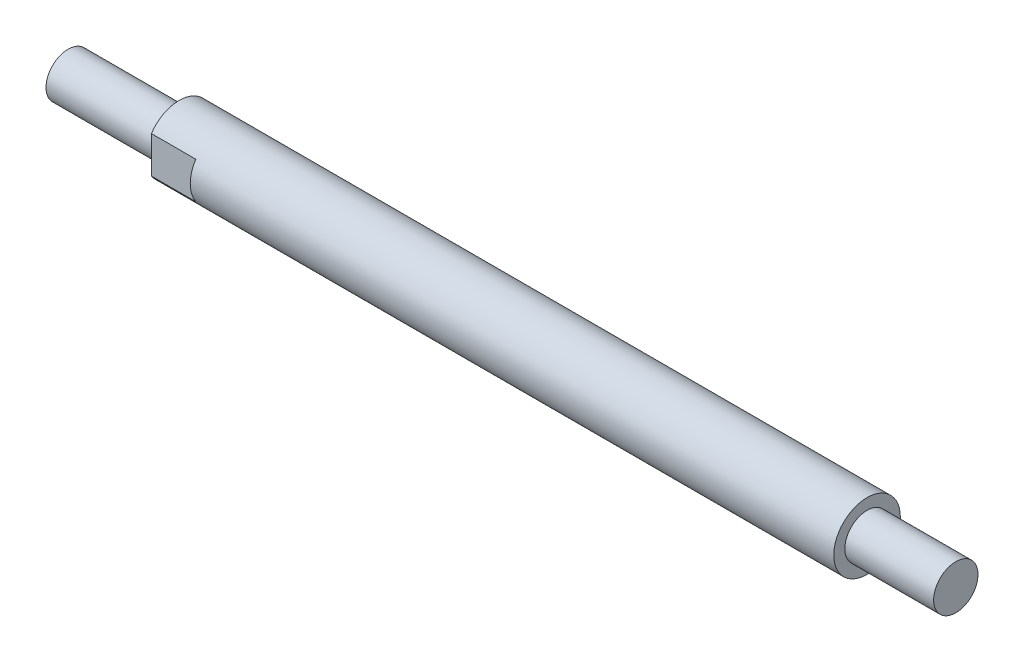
from build123d import *

# Parameters (mm, degrees)
SKETCH1_R           = 4.7625
BASE_EXTRUDE_DEPTH  = 114.3
SKETCH2_R           = 3.175
BOSS_EXTRUDE1_DEPTH = 12.7
SKETCH3_R           = 4.7625
SKETCH3_R_2         = 3.175
CUT_EXTRUDE1_DEPTH  = 15.875
CUT_EXTRUDE2_DEPTH  = 6.35


with BuildPart() as part:
    # Sketch1 → Base-Extrude (new body)
    with BuildSketch(Plane(origin=(0, 0, 0), x_dir=(0, 0, -1), z_dir=(1, 0, 0))):
        Circle(SKETCH1_R)
    extrude(amount=BASE_EXTRUDE_DEPTH)

    # Sketch2 → Boss-Extrude1 (add)
    with BuildSketch(Plane(origin=(114.3, 0, 0), x_dir=(0, 0, -1), z_dir=(1, 0, 0))):
        Circle(SKETCH2_R)
    extrude(amount=BOSS_EXTRUDE1_DEPTH)

    # Sketch3 → Cut-Extrude1 (cut)
    with BuildSketch(Plane.ZY):
        Circle(SKETCH3_R)
        with Locations(Location((0, 0, 0), (0, 0, 180))):
            Circle(SKETCH3_R_2, mode=Mode.SUBTRACT)
    extrude(amount=-CUT_EXTRUDE1_DEPTH, mode=Mode.SUBTRACT)

    # Sketch4 → Cut-Extrude2 (cut)
    with BuildSketch(Plane.ZY.offset(-15.875)):
        with BuildLine():
            Line((3.96875, 2.632570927), (3.96875, -2.632570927))
            ThreePointArc((3.96875, -2.632570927), (4.7625, 0), (3.96875, 2.632570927))
        make_face()
        with BuildLine():
            Line((-3.96875, -2.632570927), (-3.96875, 2.632570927))
            ThreePointArc((-3.96875, 2.632570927), (-4.7625, 0), (-3.96875, -2.632570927))
        make_face()
    extrude(amount=-CUT_EXTRUDE2_DEPTH, mode=Mode.SUBTRACT)


solid = part.part
